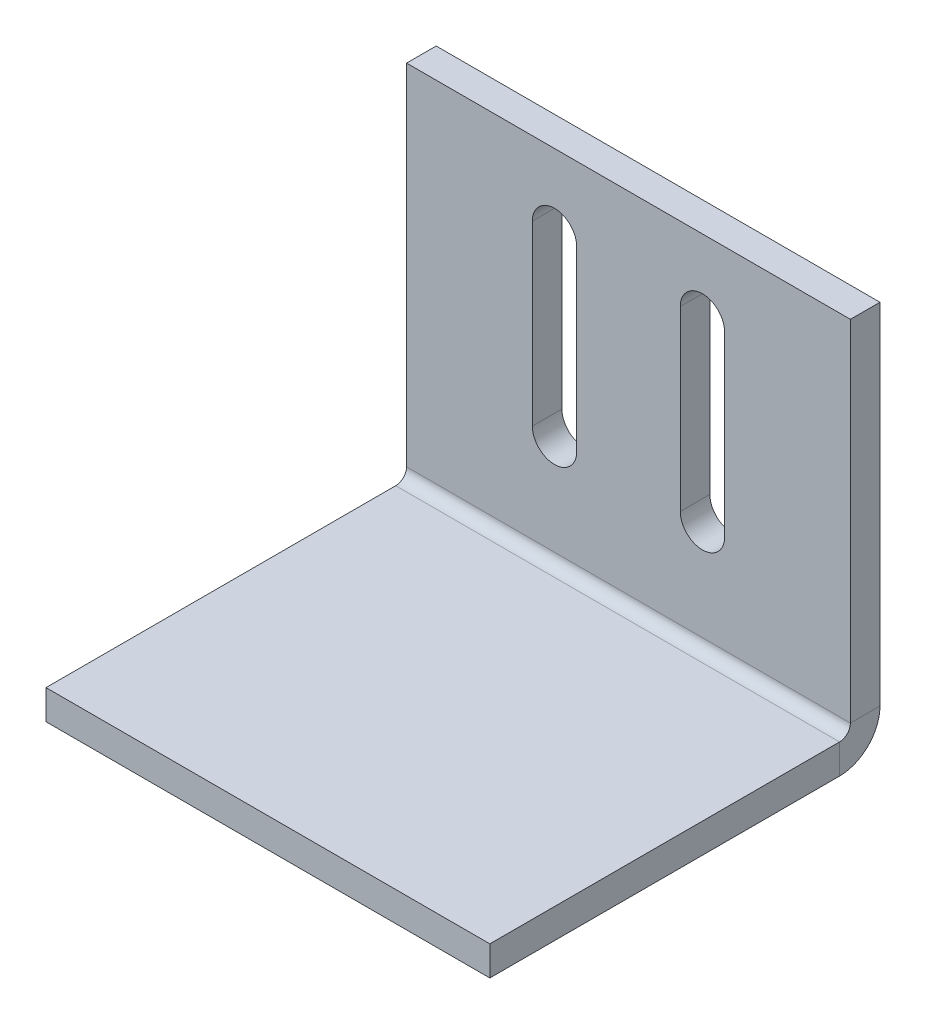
ISO-10303-21;
HEADER;
FILE_DESCRIPTION(('STEP AP214'),'2;1');
FILE_NAME('part.step','',(''),(''),'','','');
FILE_SCHEMA(('AUTOMOTIVE_DESIGN { 1 0 10303 214 1 1 1 1 }'));
ENDSEC;
DATA;
#1=APPLICATION_CONTEXT('core data for automotive mechanical design processes');
#2=APPLICATION_PROTOCOL_DEFINITION('international standard','automotive_design',2000,#1);
#3=PRODUCT_CONTEXT('',#1,'mechanical');
#4=PRODUCT('Part','Part','',(#3));
#5=PRODUCT_RELATED_PRODUCT_CATEGORY('part','',(#4));
#6=PRODUCT_DEFINITION_FORMATION('','',#4);
#7=PRODUCT_DEFINITION_CONTEXT('part definition',#1,'design');
#8=PRODUCT_DEFINITION('design','',#6,#7);
#9=PRODUCT_DEFINITION_SHAPE('','',#8);
#10=(LENGTH_UNIT() NAMED_UNIT(*) SI_UNIT(.MILLI.,.METRE.));
#11=(NAMED_UNIT(*) PLANE_ANGLE_UNIT() SI_UNIT($,.RADIAN.));
#12=(NAMED_UNIT(*) SI_UNIT($,.STERADIAN.) SOLID_ANGLE_UNIT());
#13=UNCERTAINTY_MEASURE_WITH_UNIT(LENGTH_MEASURE(1.E-05),#10,'distance_accuracy_value','');
#14=(GEOMETRIC_REPRESENTATION_CONTEXT(3) GLOBAL_UNCERTAINTY_ASSIGNED_CONTEXT((#13)) GLOBAL_UNIT_ASSIGNED_CONTEXT((#10,
#11,#12)) REPRESENTATION_CONTEXT('',''));
#15=CARTESIAN_POINT('',(0.,0.,0.));
#16=DIRECTION('',(0.,0.,1.));
#17=DIRECTION('',(1.,0.,0.));
#18=AXIS2_PLACEMENT_3D('',#15,#16,#17);
#19=CARTESIAN_POINT('',(-15.,-25.,2.));
#20=DIRECTION('',(0.,0.,1.));
#21=DIRECTION('',(1.,0.,0.));
#22=AXIS2_PLACEMENT_3D('',#19,#20,#21);
#23=PLANE('',#22);
#24=CARTESIAN_POINT('',(-5.00000000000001,20.,2.));
#25=DIRECTION('',(0.,0.,1.));
#26=DIRECTION('',(1.,0.,0.));
#27=AXIS2_PLACEMENT_3D('',#24,#25,#26);
#28=CIRCLE('',#27,1.5);
#29=CARTESIAN_POINT('',(-3.50000000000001,20.,2.));
#30=VERTEX_POINT('',#29);
#31=CARTESIAN_POINT('',(-6.50000000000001,20.,2.));
#32=VERTEX_POINT('',#31);
#33=EDGE_CURVE('E63',#30,#32,#28,.T.);
#34=ORIENTED_EDGE('',*,*,#33,.F.);
#35=DIRECTION('',(0.,-1.,0.));
#36=VECTOR('',#35,1.);
#37=CARTESIAN_POINT('',(-3.50000000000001,20.,2.));
#38=LINE('',#37,#36);
#39=CARTESIAN_POINT('',(-3.50000000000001,8.,2.));
#40=VERTEX_POINT('',#39);
#41=EDGE_CURVE('E168',#30,#40,#38,.T.);
#42=ORIENTED_EDGE('',*,*,#41,.T.);
#43=CARTESIAN_POINT('',(-5.00000000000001,8.,2.));
#44=DIRECTION('',(0.,0.,-1.));
#45=DIRECTION('',(-1.,0.,0.));
#46=AXIS2_PLACEMENT_3D('',#43,#44,#45);
#47=CIRCLE('',#46,1.5);
#48=CARTESIAN_POINT('',(-6.50000000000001,8.,2.));
#49=VERTEX_POINT('',#48);
#50=EDGE_CURVE('E190',#40,#49,#47,.T.);
#51=ORIENTED_EDGE('',*,*,#50,.T.);
#52=DIRECTION('',(0.,-1.,0.));
#53=VECTOR('',#52,1.);
#54=CARTESIAN_POINT('',(-6.50000000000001,20.,2.));
#55=LINE('',#54,#53);
#56=EDGE_CURVE('E193',#32,#49,#55,.T.);
#57=ORIENTED_EDGE('',*,*,#56,.F.);
#58=EDGE_LOOP('',(#34,#42,#51,#57));
#59=FACE_BOUND('',#58,.T.);
#60=DIRECTION('',(-1.,0.,0.));
#61=VECTOR('',#60,1.);
#62=CARTESIAN_POINT('',(-15.,1.36392245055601,2.));
#63=LINE('',#62,#61);
#64=CARTESIAN_POINT('',(15.,1.36392245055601,2.00000000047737));
#65=VERTEX_POINT('',#64);
#66=CARTESIAN_POINT('',(-15.,1.36392245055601,2.00000000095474));
#67=VERTEX_POINT('',#66);
#68=EDGE_CURVE('E238',#65,#67,#63,.T.);
#69=ORIENTED_EDGE('',*,*,#68,.F.);
#70=DIRECTION('',(0.,1.,0.));
#71=VECTOR('',#70,1.);
#72=CARTESIAN_POINT('',(15.,25.,2.));
#73=LINE('',#72,#71);
#74=CARTESIAN_POINT('',(15.,25.,2.));
#75=VERTEX_POINT('',#74);
#76=EDGE_CURVE('E262',#65,#75,#73,.T.);
#77=ORIENTED_EDGE('',*,*,#76,.T.);
#78=DIRECTION('',(-1.,0.,0.));
#79=VECTOR('',#78,1.);
#80=CARTESIAN_POINT('',(-15.,25.,2.));
#81=LINE('',#80,#79);
#82=CARTESIAN_POINT('',(-15.,25.,2.));
#83=VERTEX_POINT('',#82);
#84=EDGE_CURVE('E260',#75,#83,#81,.T.);
#85=ORIENTED_EDGE('',*,*,#84,.T.);
#86=DIRECTION('',(0.,-1.,0.));
#87=VECTOR('',#86,1.);
#88=CARTESIAN_POINT('',(-15.,25.,2.));
#89=LINE('',#88,#87);
#90=EDGE_CURVE('E257',#83,#67,#89,.T.);
#91=ORIENTED_EDGE('',*,*,#90,.T.);
#92=EDGE_LOOP('',(#69,#77,#85,#91));
#93=FACE_BOUND('',#92,.T.);
#94=CARTESIAN_POINT('',(4.99999999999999,20.,2.));
#95=DIRECTION('',(0.,0.,1.));
#96=DIRECTION('',(1.,0.,0.));
#97=AXIS2_PLACEMENT_3D('',#94,#95,#96);
#98=CIRCLE('',#97,1.5);
#99=CARTESIAN_POINT('',(6.49999999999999,20.,2.));
#100=VERTEX_POINT('',#99);
#101=CARTESIAN_POINT('',(3.49999999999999,20.,2.));
#102=VERTEX_POINT('',#101);
#103=EDGE_CURVE('E205',#100,#102,#98,.T.);
#104=ORIENTED_EDGE('',*,*,#103,.F.);
#105=DIRECTION('',(0.,-1.,0.));
#106=VECTOR('',#105,1.);
#107=CARTESIAN_POINT('',(6.49999999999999,20.,2.));
#108=LINE('',#107,#106);
#109=CARTESIAN_POINT('',(6.5,8.,2.));
#110=VERTEX_POINT('',#109);
#111=EDGE_CURVE('E196',#100,#110,#108,.T.);
#112=ORIENTED_EDGE('',*,*,#111,.T.);
#113=CARTESIAN_POINT('',(4.99999999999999,8.,2.));
#114=DIRECTION('',(0.,0.,-1.));
#115=DIRECTION('',(-1.,0.,0.));
#116=AXIS2_PLACEMENT_3D('',#113,#114,#115);
#117=CIRCLE('',#116,1.5);
#118=CARTESIAN_POINT('',(3.49999999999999,8.,2.));
#119=VERTEX_POINT('',#118);
#120=EDGE_CURVE('E199',#110,#119,#117,.T.);
#121=ORIENTED_EDGE('',*,*,#120,.T.);
#122=DIRECTION('',(0.,-1.,0.));
#123=VECTOR('',#122,1.);
#124=CARTESIAN_POINT('',(3.49999999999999,20.,2.));
#125=LINE('',#124,#123);
#126=EDGE_CURVE('E202',#102,#119,#125,.T.);
#127=ORIENTED_EDGE('',*,*,#126,.F.);
#128=EDGE_LOOP('',(#104,#112,#121,#127));
#129=FACE_BOUND('',#128,.T.);
#130=ADVANCED_FACE('F46',(#59,#93,#129),#23,.T.);
#131=CARTESIAN_POINT('',(-15.,-25.,0.));
#132=DIRECTION('',(0.,0.,1.));
#133=DIRECTION('',(1.,0.,0.));
#134=AXIS2_PLACEMENT_3D('',#131,#132,#133);
#135=PLANE('',#134);
#136=DIRECTION('',(0.,-1.,0.));
#137=VECTOR('',#136,1.);
#138=CARTESIAN_POINT('',(-3.50000000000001,20.,0.));
#139=LINE('',#138,#137);
#140=CARTESIAN_POINT('',(-3.50000000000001,20.,0.));
#141=VERTEX_POINT('',#140);
#142=CARTESIAN_POINT('',(-3.50000000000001,8.,0.));
#143=VERTEX_POINT('',#142);
#144=EDGE_CURVE('E165',#141,#143,#139,.T.);
#145=ORIENTED_EDGE('',*,*,#144,.F.);
#146=CARTESIAN_POINT('',(-5.00000000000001,20.,0.));
#147=DIRECTION('',(0.,0.,1.));
#148=DIRECTION('',(1.,0.,0.));
#149=AXIS2_PLACEMENT_3D('',#146,#147,#148);
#150=CIRCLE('',#149,1.5);
#151=CARTESIAN_POINT('',(-6.50000000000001,20.,0.));
#152=VERTEX_POINT('',#151);
#153=EDGE_CURVE('E172',#141,#152,#150,.T.);
#154=ORIENTED_EDGE('',*,*,#153,.T.);
#155=DIRECTION('',(0.,-1.,0.));
#156=VECTOR('',#155,1.);
#157=CARTESIAN_POINT('',(-6.50000000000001,20.,0.));
#158=LINE('',#157,#156);
#159=CARTESIAN_POINT('',(-6.50000000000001,8.,0.));
#160=VERTEX_POINT('',#159);
#161=EDGE_CURVE('E177',#152,#160,#158,.T.);
#162=ORIENTED_EDGE('',*,*,#161,.T.);
#163=CARTESIAN_POINT('',(-5.00000000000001,8.,0.));
#164=DIRECTION('',(0.,0.,-1.));
#165=DIRECTION('',(-1.,0.,0.));
#166=AXIS2_PLACEMENT_3D('',#163,#164,#165);
#167=CIRCLE('',#166,1.5);
#168=EDGE_CURVE('E182',#143,#160,#167,.T.);
#169=ORIENTED_EDGE('',*,*,#168,.F.);
#170=EDGE_LOOP('',(#145,#154,#162,#169));
#171=FACE_BOUND('',#170,.T.);
#172=DIRECTION('',(0.,1.,0.));
#173=VECTOR('',#172,1.);
#174=CARTESIAN_POINT('',(15.,25.,0.));
#175=LINE('',#174,#173);
#176=CARTESIAN_POINT('',(15.,1.36392245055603,0.));
#177=VERTEX_POINT('',#176);
#178=CARTESIAN_POINT('',(15.,25.,0.));
#179=VERTEX_POINT('',#178);
#180=EDGE_CURVE('E252',#177,#179,#175,.T.);
#181=ORIENTED_EDGE('',*,*,#180,.F.);
#182=DIRECTION('',(-1.,0.,0.));
#183=VECTOR('',#182,1.);
#184=CARTESIAN_POINT('',(-15.,1.36392245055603,0.));
#185=LINE('',#184,#183);
#186=CARTESIAN_POINT('',(-15.,1.36392245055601,9.54736290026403E-10));
#187=VERTEX_POINT('',#186);
#188=EDGE_CURVE('E249',#177,#187,#185,.T.);
#189=ORIENTED_EDGE('',*,*,#188,.T.);
#190=DIRECTION('',(0.,-1.,0.));
#191=VECTOR('',#190,1.);
#192=CARTESIAN_POINT('',(-15.,25.,0.));
#193=LINE('',#192,#191);
#194=CARTESIAN_POINT('',(-15.,25.,0.));
#195=VERTEX_POINT('',#194);
#196=EDGE_CURVE('E246',#195,#187,#193,.T.);
#197=ORIENTED_EDGE('',*,*,#196,.F.);
#198=DIRECTION('',(-1.,0.,0.));
#199=VECTOR('',#198,1.);
#200=CARTESIAN_POINT('',(-15.,25.,0.));
#201=LINE('',#200,#199);
#202=EDGE_CURVE('E267',#179,#195,#201,.T.);
#203=ORIENTED_EDGE('',*,*,#202,.F.);
#204=EDGE_LOOP('',(#181,#189,#197,#203));
#205=FACE_BOUND('',#204,.T.);
#206=DIRECTION('',(0.,-1.,0.));
#207=VECTOR('',#206,1.);
#208=CARTESIAN_POINT('',(6.49999999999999,20.,0.));
#209=LINE('',#208,#207);
#210=CARTESIAN_POINT('',(6.49999999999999,20.,0.));
#211=VERTEX_POINT('',#210);
#212=CARTESIAN_POINT('',(6.5,8.,0.));
#213=VERTEX_POINT('',#212);
#214=EDGE_CURVE('E208',#211,#213,#209,.T.);
#215=ORIENTED_EDGE('',*,*,#214,.F.);
#216=CARTESIAN_POINT('',(4.99999999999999,20.,0.));
#217=DIRECTION('',(0.,0.,1.));
#218=DIRECTION('',(1.,0.,0.));
#219=AXIS2_PLACEMENT_3D('',#216,#217,#218);
#220=CIRCLE('',#219,1.5);
#221=CARTESIAN_POINT('',(3.49999999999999,20.,0.));
#222=VERTEX_POINT('',#221);
#223=EDGE_CURVE('E215',#211,#222,#220,.T.);
#224=ORIENTED_EDGE('',*,*,#223,.T.);
#225=DIRECTION('',(0.,-1.,0.));
#226=VECTOR('',#225,1.);
#227=CARTESIAN_POINT('',(3.49999999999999,20.,0.));
#228=LINE('',#227,#226);
#229=CARTESIAN_POINT('',(3.49999999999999,8.,0.));
#230=VERTEX_POINT('',#229);
#231=EDGE_CURVE('E212',#222,#230,#228,.T.);
#232=ORIENTED_EDGE('',*,*,#231,.T.);
#233=CARTESIAN_POINT('',(4.99999999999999,8.,0.));
#234=DIRECTION('',(0.,0.,-1.));
#235=DIRECTION('',(-1.,0.,0.));
#236=AXIS2_PLACEMENT_3D('',#233,#234,#235);
#237=CIRCLE('',#236,1.5);
#238=EDGE_CURVE('E210',#213,#230,#237,.T.);
#239=ORIENTED_EDGE('',*,*,#238,.F.);
#240=EDGE_LOOP('',(#215,#224,#232,#239));
#241=FACE_BOUND('',#240,.T.);
#242=ADVANCED_FACE('F180',(#171,#205,#241),#135,.F.);
#243=CARTESIAN_POINT('',(-15.,0.6273224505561,26.372677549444));
#244=DIRECTION('',(0.,1.,0.));
#245=DIRECTION('',(1.,0.,0.));
#246=AXIS2_PLACEMENT_3D('',#243,#244,#245);
#247=PLANE('',#246);
#248=DIRECTION('',(0.,0.,-1.));
#249=VECTOR('',#248,1.);
#250=CARTESIAN_POINT('',(15.,0.627322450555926,-23.627322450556));
#251=LINE('',#250,#249);
#252=CARTESIAN_POINT('',(15.,0.6273224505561,26.372677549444));
#253=VERTEX_POINT('',#252);
#254=CARTESIAN_POINT('',(15.,0.627322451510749,2.7366));
#255=VERTEX_POINT('',#254);
#256=EDGE_CURVE('E50',#253,#255,#251,.T.);
#257=ORIENTED_EDGE('',*,*,#256,.T.);
#258=DIRECTION('',(-1.,0.,0.));
#259=VECTOR('',#258,1.);
#260=CARTESIAN_POINT('',(-15.,0.627322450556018,2.73660000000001));
#261=LINE('',#260,#259);
#262=CARTESIAN_POINT('',(-15.,0.627322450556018,2.7366));
#263=VERTEX_POINT('',#262);
#264=EDGE_CURVE('E282',#255,#263,#261,.T.);
#265=ORIENTED_EDGE('',*,*,#264,.T.);
#266=DIRECTION('',(0.,0.,1.));
#267=VECTOR('',#266,1.);
#268=CARTESIAN_POINT('',(-15.,0.627322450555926,-23.627322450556));
#269=LINE('',#268,#267);
#270=CARTESIAN_POINT('',(-15.,0.6273224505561,26.372677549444));
#271=VERTEX_POINT('',#270);
#272=EDGE_CURVE('E275',#263,#271,#269,.T.);
#273=ORIENTED_EDGE('',*,*,#272,.T.);
#274=DIRECTION('',(1.,0.,0.));
#275=VECTOR('',#274,1.);
#276=CARTESIAN_POINT('',(-15.,0.6273224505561,26.372677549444));
#277=LINE('',#276,#275);
#278=EDGE_CURVE('E273',#271,#253,#277,.T.);
#279=ORIENTED_EDGE('',*,*,#278,.T.);
#280=EDGE_LOOP('',(#257,#265,#273,#279));
#281=FACE_BOUND('',#280,.T.);
#282=ADVANCED_FACE('F294',(#281),#247,.T.);
#283=CARTESIAN_POINT('',(-15.,0.627322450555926,-23.627322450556));
#284=DIRECTION('',(1.,0.,0.));
#285=DIRECTION('',(0.,0.,-1.));
#286=AXIS2_PLACEMENT_3D('',#283,#284,#285);
#287=PLANE('',#286);
#288=DIRECTION('',(0.,1.,0.));
#289=VECTOR('',#288,1.);
#290=CARTESIAN_POINT('',(-15.,0.627322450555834,2.73660000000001));
#291=LINE('',#290,#289);
#292=CARTESIAN_POINT('',(-15.,-1.37267754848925,2.7366));
#293=VERTEX_POINT('',#292);
#294=EDGE_CURVE('E12',#293,#263,#291,.T.);
#295=ORIENTED_EDGE('',*,*,#294,.F.);
#296=DIRECTION('',(0.,0.,1.));
#297=VECTOR('',#296,1.);
#298=CARTESIAN_POINT('',(-15.,-1.37267754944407,-23.627322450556));
#299=LINE('',#298,#297);
#300=CARTESIAN_POINT('',(-15.,-1.3726775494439,26.372677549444));
#301=VERTEX_POINT('',#300);
#302=EDGE_CURVE('E242',#293,#301,#299,.T.);
#303=ORIENTED_EDGE('',*,*,#302,.T.);
#304=DIRECTION('',(0.,-1.,0.));
#305=VECTOR('',#304,1.);
#306=CARTESIAN_POINT('',(-15.,0.6273224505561,26.372677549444));
#307=LINE('',#306,#305);
#308=EDGE_CURVE('E279',#271,#301,#307,.T.);
#309=ORIENTED_EDGE('',*,*,#308,.F.);
#310=ORIENTED_EDGE('',*,*,#272,.F.);
#311=EDGE_LOOP('',(#295,#303,#309,#310));
#312=FACE_BOUND('',#311,.T.);
#313=ADVANCED_FACE('F48',(#312),#287,.F.);
#314=CARTESIAN_POINT('',(-15.,0.6273224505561,26.372677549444));
#315=DIRECTION('',(0.,0.,-1.));
#316=DIRECTION('',(-1.,0.,0.));
#317=AXIS2_PLACEMENT_3D('',#314,#315,#316);
#318=PLANE('',#317);
#319=DIRECTION('',(1.,0.,0.));
#320=VECTOR('',#319,1.);
#321=CARTESIAN_POINT('',(-15.,-1.3726775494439,26.372677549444));
#322=LINE('',#321,#320);
#323=CARTESIAN_POINT('',(15.,-1.3726775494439,26.372677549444));
#324=VERTEX_POINT('',#323);
#325=EDGE_CURVE('E270',#301,#324,#322,.T.);
#326=ORIENTED_EDGE('',*,*,#325,.T.);
#327=DIRECTION('',(0.,-1.,0.));
#328=VECTOR('',#327,1.);
#329=CARTESIAN_POINT('',(15.,0.6273224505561,26.372677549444));
#330=LINE('',#329,#328);
#331=EDGE_CURVE('E276',#253,#324,#330,.T.);
#332=ORIENTED_EDGE('',*,*,#331,.F.);
#333=ORIENTED_EDGE('',*,*,#278,.F.);
#334=ORIENTED_EDGE('',*,*,#308,.T.);
#335=EDGE_LOOP('',(#326,#332,#333,#334));
#336=FACE_BOUND('',#335,.T.);
#337=ADVANCED_FACE('F300',(#336),#318,.F.);
#338=CARTESIAN_POINT('',(15.,0.627322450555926,-23.627322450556));
#339=DIRECTION('',(-1.,0.,0.));
#340=DIRECTION('',(0.,0.,1.));
#341=AXIS2_PLACEMENT_3D('',#338,#339,#340);
#342=PLANE('',#341);
#343=DIRECTION('',(0.,-1.,0.));
#344=VECTOR('',#343,1.);
#345=CARTESIAN_POINT('',(15.,0.627322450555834,2.73660000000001));
#346=LINE('',#345,#344);
#347=CARTESIAN_POINT('',(15.,-1.37267754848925,2.7366));
#348=VERTEX_POINT('',#347);
#349=EDGE_CURVE('E285',#255,#348,#346,.T.);
#350=ORIENTED_EDGE('',*,*,#349,.F.);
#351=ORIENTED_EDGE('',*,*,#256,.F.);
#352=ORIENTED_EDGE('',*,*,#331,.T.);
#353=DIRECTION('',(0.,0.,-1.));
#354=VECTOR('',#353,1.);
#355=CARTESIAN_POINT('',(15.,-1.37267754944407,-23.627322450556));
#356=LINE('',#355,#354);
#357=EDGE_CURVE('E272',#324,#348,#356,.T.);
#358=ORIENTED_EDGE('',*,*,#357,.T.);
#359=EDGE_LOOP('',(#350,#351,#352,#358));
#360=FACE_BOUND('',#359,.T.);
#361=ADVANCED_FACE('F310',(#360),#342,.F.);
#362=CARTESIAN_POINT('',(-15.,-1.3726775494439,26.372677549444));
#363=DIRECTION('',(0.,1.,0.));
#364=DIRECTION('',(1.,0.,0.));
#365=AXIS2_PLACEMENT_3D('',#362,#363,#364);
#366=PLANE('',#365);
#367=DIRECTION('',(-1.,0.,0.));
#368=VECTOR('',#367,1.);
#369=CARTESIAN_POINT('',(-15.,-1.37267754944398,2.7366));
#370=LINE('',#369,#368);
#371=EDGE_CURVE('E55',#348,#293,#370,.T.);
#372=ORIENTED_EDGE('',*,*,#371,.F.);
#373=ORIENTED_EDGE('',*,*,#357,.F.);
#374=ORIENTED_EDGE('',*,*,#325,.F.);
#375=ORIENTED_EDGE('',*,*,#302,.F.);
#376=EDGE_LOOP('',(#372,#373,#374,#375));
#377=FACE_BOUND('',#376,.T.);
#378=ADVANCED_FACE('F307',(#377),#366,.F.);
#379=CARTESIAN_POINT('',(-15.,25.,2.));
#380=DIRECTION('',(0.,-1.,0.));
#381=DIRECTION('',(1.,0.,0.));
#382=AXIS2_PLACEMENT_3D('',#379,#380,#381);
#383=PLANE('',#382);
#384=ORIENTED_EDGE('',*,*,#202,.T.);
#385=DIRECTION('',(0.,0.,-1.));
#386=VECTOR('',#385,1.);
#387=CARTESIAN_POINT('',(-15.,25.,2.));
#388=LINE('',#387,#386);
#389=EDGE_CURVE('E239',#83,#195,#388,.T.);
#390=ORIENTED_EDGE('',*,*,#389,.F.);
#391=ORIENTED_EDGE('',*,*,#84,.F.);
#392=DIRECTION('',(0.,0.,-1.));
#393=VECTOR('',#392,1.);
#394=CARTESIAN_POINT('',(15.,25.,2.));
#395=LINE('',#394,#393);
#396=EDGE_CURVE('E264',#75,#179,#395,.T.);
#397=ORIENTED_EDGE('',*,*,#396,.T.);
#398=EDGE_LOOP('',(#384,#390,#391,#397));
#399=FACE_BOUND('',#398,.T.);
#400=ADVANCED_FACE('F360',(#399),#383,.F.);
#401=CARTESIAN_POINT('',(15.,25.,2.));
#402=DIRECTION('',(-1.,0.,0.));
#403=DIRECTION('',(0.,-1.,0.));
#404=AXIS2_PLACEMENT_3D('',#401,#402,#403);
#405=PLANE('',#404);
#406=ORIENTED_EDGE('',*,*,#76,.F.);
#407=DIRECTION('',(0.,0.,-1.));
#408=VECTOR('',#407,1.);
#409=CARTESIAN_POINT('',(15.,1.36392245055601,1.99999999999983));
#410=LINE('',#409,#408);
#411=EDGE_CURVE('E254',#65,#177,#410,.T.);
#412=ORIENTED_EDGE('',*,*,#411,.T.);
#413=ORIENTED_EDGE('',*,*,#180,.T.);
#414=ORIENTED_EDGE('',*,*,#396,.F.);
#415=EDGE_LOOP('',(#406,#412,#413,#414));
#416=FACE_BOUND('',#415,.T.);
#417=ADVANCED_FACE('F326',(#416),#405,.F.);
#418=CARTESIAN_POINT('',(-15.,25.,2.));
#419=DIRECTION('',(1.,0.,0.));
#420=DIRECTION('',(0.,1.,0.));
#421=AXIS2_PLACEMENT_3D('',#418,#419,#420);
#422=PLANE('',#421);
#423=ORIENTED_EDGE('',*,*,#196,.T.);
#424=DIRECTION('',(0.,0.,1.));
#425=VECTOR('',#424,1.);
#426=CARTESIAN_POINT('',(-15.,1.36392245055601,1.99999999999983));
#427=LINE('',#426,#425);
#428=EDGE_CURVE('E243',#187,#67,#427,.T.);
#429=ORIENTED_EDGE('',*,*,#428,.T.);
#430=ORIENTED_EDGE('',*,*,#90,.F.);
#431=ORIENTED_EDGE('',*,*,#389,.T.);
#432=EDGE_LOOP('',(#423,#429,#430,#431));
#433=FACE_BOUND('',#432,.T.);
#434=ADVANCED_FACE('F337',(#433),#422,.F.);
#435=CARTESIAN_POINT('',(15.,1.36392245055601,2.73659999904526));
#436=DIRECTION('',(-1.,0.,0.));
#437=DIRECTION('',(0.,0.,1.));
#438=AXIS2_PLACEMENT_3D('',#435,#436,#437);
#439=PLANE('',#438);
#440=ORIENTED_EDGE('',*,*,#349,.T.);
#441=CARTESIAN_POINT('',(15.,1.36392245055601,2.7366));
#442=DIRECTION('',(1.,0.,0.));
#443=DIRECTION('',(0.,0.,-1.));
#444=AXIS2_PLACEMENT_3D('',#441,#442,#443);
#445=CIRCLE('',#444,2.73659999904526);
#446=EDGE_CURVE('E228',#348,#177,#445,.T.);
#447=ORIENTED_EDGE('',*,*,#446,.T.);
#448=ORIENTED_EDGE('',*,*,#411,.F.);
#449=CARTESIAN_POINT('',(15.,1.36392245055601,2.73659999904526));
#450=DIRECTION('',(1.,0.,0.));
#451=DIRECTION('',(0.,0.,-1.));
#452=AXIS2_PLACEMENT_3D('',#449,#450,#451);
#453=CIRCLE('',#452,0.736599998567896);
#454=EDGE_CURVE('E233',#255,#65,#453,.T.);
#455=ORIENTED_EDGE('',*,*,#454,.F.);
#456=EDGE_LOOP('',(#440,#447,#448,#455));
#457=FACE_BOUND('',#456,.T.);
#458=ADVANCED_FACE('F314',(#457),#439,.F.);
#459=CARTESIAN_POINT('',(-15.,1.36392245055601,2.73659999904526));
#460=DIRECTION('',(1.,0.,0.));
#461=DIRECTION('',(0.,0.,-1.));
#462=AXIS2_PLACEMENT_3D('',#459,#460,#461);
#463=PLANE('',#462);
#464=CARTESIAN_POINT('',(-15.,1.36392245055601,2.7366));
#465=DIRECTION('',(1.,0.,0.));
#466=DIRECTION('',(0.,0.,-1.));
#467=AXIS2_PLACEMENT_3D('',#464,#465,#466);
#468=CIRCLE('',#467,2.73659999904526);
#469=EDGE_CURVE('E230',#187,#293,#468,.F.);
#470=ORIENTED_EDGE('',*,*,#469,.T.);
#471=ORIENTED_EDGE('',*,*,#294,.T.);
#472=CARTESIAN_POINT('',(-15.,1.36392245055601,2.73659999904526));
#473=DIRECTION('',(-1.,0.,0.));
#474=DIRECTION('',(0.,0.,1.));
#475=AXIS2_PLACEMENT_3D('',#472,#473,#474);
#476=CIRCLE('',#475,0.736599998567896);
#477=EDGE_CURVE('E236',#67,#263,#476,.T.);
#478=ORIENTED_EDGE('',*,*,#477,.F.);
#479=ORIENTED_EDGE('',*,*,#428,.F.);
#480=EDGE_LOOP('',(#470,#471,#478,#479));
#481=FACE_BOUND('',#480,.T.);
#482=ADVANCED_FACE('F339',(#481),#463,.F.);
#483=CARTESIAN_POINT('',(-30.1900834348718,1.36392245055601,2.7366));
#484=DIRECTION('',(1.,0.,0.));
#485=DIRECTION('',(0.,0.,-1.));
#486=AXIS2_PLACEMENT_3D('',#483,#484,#485);
#487=CYLINDRICAL_SURFACE('',#486,0.736599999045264);
#488=ORIENTED_EDGE('',*,*,#68,.T.);
#489=ORIENTED_EDGE('',*,*,#477,.T.);
#490=ORIENTED_EDGE('',*,*,#264,.F.);
#491=ORIENTED_EDGE('',*,*,#454,.T.);
#492=EDGE_LOOP('',(#488,#489,#490,#491));
#493=FACE_BOUND('',#492,.T.);
#494=ADVANCED_FACE('F329',(#493),#487,.F.);
#495=CARTESIAN_POINT('',(-30.1900834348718,1.36392245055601,2.7366));
#496=DIRECTION('',(1.,0.,0.));
#497=DIRECTION('',(0.,0.,-1.));
#498=AXIS2_PLACEMENT_3D('',#495,#496,#497);
#499=CYLINDRICAL_SURFACE('',#498,2.73659999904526);
#500=ORIENTED_EDGE('',*,*,#188,.F.);
#501=ORIENTED_EDGE('',*,*,#446,.F.);
#502=ORIENTED_EDGE('',*,*,#371,.T.);
#503=ORIENTED_EDGE('',*,*,#469,.F.);
#504=EDGE_LOOP('',(#500,#501,#502,#503));
#505=FACE_BOUND('',#504,.T.);
#506=ADVANCED_FACE('F317',(#505),#499,.T.);
#507=CARTESIAN_POINT('',(6.49999999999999,20.,0.));
#508=DIRECTION('',(-1.,0.,0.));
#509=DIRECTION('',(0.,-1.,0.));
#510=AXIS2_PLACEMENT_3D('',#507,#508,#509);
#511=PLANE('',#510);
#512=ORIENTED_EDGE('',*,*,#111,.F.);
#513=DIRECTION('',(0.,0.,1.));
#514=VECTOR('',#513,1.);
#515=CARTESIAN_POINT('',(6.49999999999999,20.,0.));
#516=LINE('',#515,#514);
#517=EDGE_CURVE('E218',#211,#100,#516,.T.);
#518=ORIENTED_EDGE('',*,*,#517,.F.);
#519=ORIENTED_EDGE('',*,*,#214,.T.);
#520=DIRECTION('',(0.,0.,1.));
#521=VECTOR('',#520,1.);
#522=CARTESIAN_POINT('',(6.5,8.,0.));
#523=LINE('',#522,#521);
#524=EDGE_CURVE('E225',#213,#110,#523,.T.);
#525=ORIENTED_EDGE('',*,*,#524,.T.);
#526=EDGE_LOOP('',(#512,#518,#519,#525));
#527=FACE_BOUND('',#526,.T.);
#528=ADVANCED_FACE('F350',(#527),#511,.T.);
#529=CARTESIAN_POINT('',(4.99999999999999,8.,0.));
#530=DIRECTION('',(0.,0.,1.));
#531=DIRECTION('',(1.,0.,0.));
#532=AXIS2_PLACEMENT_3D('',#529,#530,#531);
#533=CYLINDRICAL_SURFACE('',#532,1.5);
#534=ORIENTED_EDGE('',*,*,#120,.F.);
#535=ORIENTED_EDGE('',*,*,#524,.F.);
#536=ORIENTED_EDGE('',*,*,#238,.T.);
#537=DIRECTION('',(0.,0.,1.));
#538=VECTOR('',#537,1.);
#539=CARTESIAN_POINT('',(3.49999999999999,8.,0.));
#540=LINE('',#539,#538);
#541=EDGE_CURVE('E223',#230,#119,#540,.T.);
#542=ORIENTED_EDGE('',*,*,#541,.T.);
#543=EDGE_LOOP('',(#534,#535,#536,#542));
#544=FACE_BOUND('',#543,.T.);
#545=ADVANCED_FACE('F430',(#544),#533,.F.);
#546=CARTESIAN_POINT('',(3.49999999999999,20.,0.));
#547=DIRECTION('',(-1.,0.,0.));
#548=DIRECTION('',(0.,-1.,0.));
#549=AXIS2_PLACEMENT_3D('',#546,#547,#548);
#550=PLANE('',#549);
#551=ORIENTED_EDGE('',*,*,#126,.T.);
#552=ORIENTED_EDGE('',*,*,#541,.F.);
#553=ORIENTED_EDGE('',*,*,#231,.F.);
#554=DIRECTION('',(0.,0.,1.));
#555=VECTOR('',#554,1.);
#556=CARTESIAN_POINT('',(3.49999999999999,20.,0.));
#557=LINE('',#556,#555);
#558=EDGE_CURVE('E221',#222,#102,#557,.T.);
#559=ORIENTED_EDGE('',*,*,#558,.T.);
#560=EDGE_LOOP('',(#551,#552,#553,#559));
#561=FACE_BOUND('',#560,.T.);
#562=ADVANCED_FACE('F440',(#561),#550,.F.);
#563=CARTESIAN_POINT('',(4.99999999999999,20.,0.));
#564=DIRECTION('',(0.,0.,1.));
#565=DIRECTION('',(1.,0.,0.));
#566=AXIS2_PLACEMENT_3D('',#563,#564,#565);
#567=CYLINDRICAL_SURFACE('',#566,1.5);
#568=ORIENTED_EDGE('',*,*,#103,.T.);
#569=ORIENTED_EDGE('',*,*,#558,.F.);
#570=ORIENTED_EDGE('',*,*,#223,.F.);
#571=ORIENTED_EDGE('',*,*,#517,.T.);
#572=EDGE_LOOP('',(#568,#569,#570,#571));
#573=FACE_BOUND('',#572,.T.);
#574=ADVANCED_FACE('F450',(#573),#567,.F.);
#575=CARTESIAN_POINT('',(-5.00000000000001,20.,0.));
#576=DIRECTION('',(0.,0.,1.));
#577=DIRECTION('',(1.,0.,0.));
#578=AXIS2_PLACEMENT_3D('',#575,#576,#577);
#579=CYLINDRICAL_SURFACE('',#578,1.5);
#580=ORIENTED_EDGE('',*,*,#33,.T.);
#581=DIRECTION('',(0.,0.,1.));
#582=VECTOR('',#581,1.);
#583=CARTESIAN_POINT('',(-6.50000000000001,20.,0.));
#584=LINE('',#583,#582);
#585=EDGE_CURVE('E174',#152,#32,#584,.T.);
#586=ORIENTED_EDGE('',*,*,#585,.F.);
#587=ORIENTED_EDGE('',*,*,#153,.F.);
#588=DIRECTION('',(0.,0.,1.));
#589=VECTOR('',#588,1.);
#590=CARTESIAN_POINT('',(-3.50000000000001,20.,0.));
#591=LINE('',#590,#589);
#592=EDGE_CURVE('E161',#141,#30,#591,.T.);
#593=ORIENTED_EDGE('',*,*,#592,.T.);
#594=EDGE_LOOP('',(#580,#586,#587,#593));
#595=FACE_BOUND('',#594,.T.);
#596=ADVANCED_FACE('F173',(#595),#579,.F.);
#597=CARTESIAN_POINT('',(-3.50000000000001,20.,0.));
#598=DIRECTION('',(-1.,0.,0.));
#599=DIRECTION('',(0.,0.,1.));
#600=AXIS2_PLACEMENT_3D('',#597,#598,#599);
#601=PLANE('',#600);
#602=ORIENTED_EDGE('',*,*,#41,.F.);
#603=ORIENTED_EDGE('',*,*,#592,.F.);
#604=ORIENTED_EDGE('',*,*,#144,.T.);
#605=DIRECTION('',(0.,0.,1.));
#606=VECTOR('',#605,1.);
#607=CARTESIAN_POINT('',(-3.50000000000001,8.,0.));
#608=LINE('',#607,#606);
#609=EDGE_CURVE('E169',#143,#40,#608,.T.);
#610=ORIENTED_EDGE('',*,*,#609,.T.);
#611=EDGE_LOOP('',(#602,#603,#604,#610));
#612=FACE_BOUND('',#611,.T.);
#613=ADVANCED_FACE('F163',(#612),#601,.T.);
#614=CARTESIAN_POINT('',(-5.00000000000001,8.,0.));
#615=DIRECTION('',(0.,0.,1.));
#616=DIRECTION('',(1.,0.,0.));
#617=AXIS2_PLACEMENT_3D('',#614,#615,#616);
#618=CYLINDRICAL_SURFACE('',#617,1.5);
#619=ORIENTED_EDGE('',*,*,#50,.F.);
#620=ORIENTED_EDGE('',*,*,#609,.F.);
#621=ORIENTED_EDGE('',*,*,#168,.T.);
#622=DIRECTION('',(0.,0.,1.));
#623=VECTOR('',#622,1.);
#624=CARTESIAN_POINT('',(-6.50000000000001,8.,0.));
#625=LINE('',#624,#623);
#626=EDGE_CURVE('E71',#160,#49,#625,.T.);
#627=ORIENTED_EDGE('',*,*,#626,.T.);
#628=EDGE_LOOP('',(#619,#620,#621,#627));
#629=FACE_BOUND('',#628,.T.);
#630=ADVANCED_FACE('F477',(#629),#618,.F.);
#631=CARTESIAN_POINT('',(-6.50000000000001,20.,0.));
#632=DIRECTION('',(-1.,0.,0.));
#633=DIRECTION('',(0.,-1.,0.));
#634=AXIS2_PLACEMENT_3D('',#631,#632,#633);
#635=PLANE('',#634);
#636=ORIENTED_EDGE('',*,*,#56,.T.);
#637=ORIENTED_EDGE('',*,*,#626,.F.);
#638=ORIENTED_EDGE('',*,*,#161,.F.);
#639=ORIENTED_EDGE('',*,*,#585,.T.);
#640=EDGE_LOOP('',(#636,#637,#638,#639));
#641=FACE_BOUND('',#640,.T.);
#642=ADVANCED_FACE('F486',(#641),#635,.F.);
#643=CLOSED_SHELL('',(#130,#242,#282,#313,#337,#361,#378,#400,#417,#434,#458,#482,#494,#506,
#528,#545,#562,#574,#596,#613,#630,#642));
#644=MANIFOLD_SOLID_BREP('B2',#643);
#645=ADVANCED_BREP_SHAPE_REPRESENTATION('',(#18,#644),#14);
#646=SHAPE_DEFINITION_REPRESENTATION(#9,#645);
ENDSEC;
END-ISO-10303-21;
